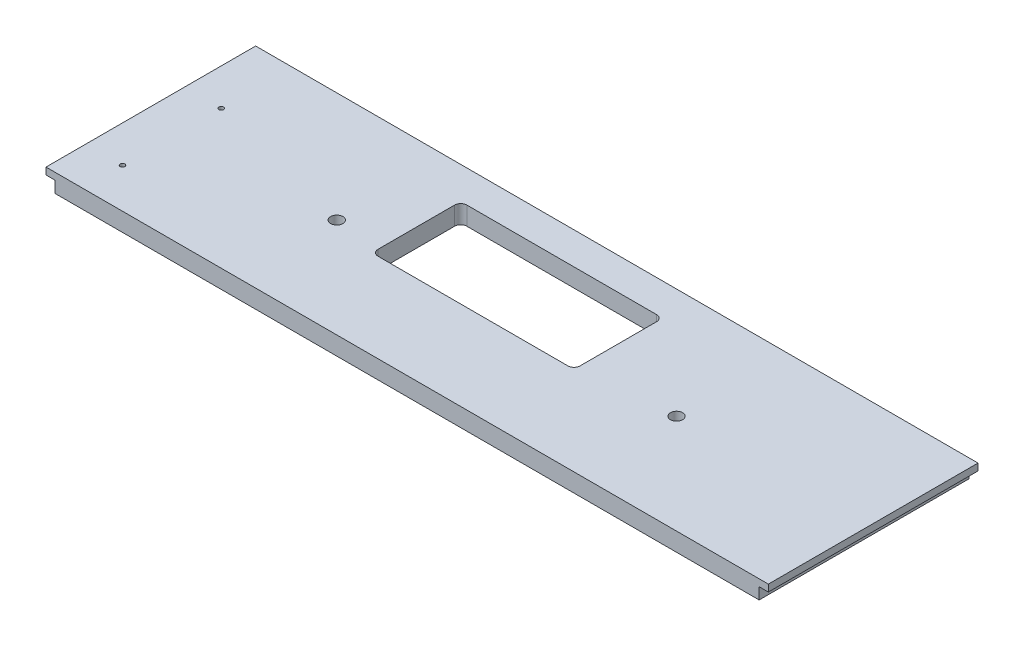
ISO-10303-21;
HEADER;
FILE_DESCRIPTION(('STEP AP214'),'2;1');
FILE_NAME('part.step','',(''),(''),'','','');
FILE_SCHEMA(('AUTOMOTIVE_DESIGN { 1 0 10303 214 1 1 1 1 }'));
ENDSEC;
DATA;
#1=APPLICATION_CONTEXT('core data for automotive mechanical design processes');
#2=APPLICATION_PROTOCOL_DEFINITION('international standard','automotive_design',2000,#1);
#3=PRODUCT_CONTEXT('',#1,'mechanical');
#4=PRODUCT('Part','Part','',(#3));
#5=PRODUCT_RELATED_PRODUCT_CATEGORY('part','',(#4));
#6=PRODUCT_DEFINITION_FORMATION('','',#4);
#7=PRODUCT_DEFINITION_CONTEXT('part definition',#1,'design');
#8=PRODUCT_DEFINITION('design','',#6,#7);
#9=PRODUCT_DEFINITION_SHAPE('','',#8);
#10=(LENGTH_UNIT() NAMED_UNIT(*) SI_UNIT(.MILLI.,.METRE.));
#11=(NAMED_UNIT(*) PLANE_ANGLE_UNIT() SI_UNIT($,.RADIAN.));
#12=(NAMED_UNIT(*) SI_UNIT($,.STERADIAN.) SOLID_ANGLE_UNIT());
#13=UNCERTAINTY_MEASURE_WITH_UNIT(LENGTH_MEASURE(1.E-05),#10,'distance_accuracy_value','');
#14=(GEOMETRIC_REPRESENTATION_CONTEXT(3) GLOBAL_UNCERTAINTY_ASSIGNED_CONTEXT((#13)) GLOBAL_UNIT_ASSIGNED_CONTEXT((#10,
#11,#12)) REPRESENTATION_CONTEXT('',''));
#15=CARTESIAN_POINT('',(0.,0.,0.));
#16=DIRECTION('',(0.,0.,1.));
#17=DIRECTION('',(1.,0.,0.));
#18=AXIS2_PLACEMENT_3D('',#15,#16,#17);
#19=CARTESIAN_POINT('',(374.65,19.05,-108.74375));
#20=DIRECTION('',(-1.,0.,0.));
#21=DIRECTION('',(0.,0.,1.));
#22=AXIS2_PLACEMENT_3D('',#19,#20,#21);
#23=PLANE('',#22);
#24=DIRECTION('',(0.,-1.,0.));
#25=VECTOR('',#24,1.);
#26=CARTESIAN_POINT('',(374.65,19.05,108.74375));
#27=LINE('',#26,#25);
#28=CARTESIAN_POINT('',(374.65,19.05,108.74375));
#29=VERTEX_POINT('',#28);
#30=CARTESIAN_POINT('',(374.65,11.90625,108.74375));
#31=VERTEX_POINT('',#30);
#32=EDGE_CURVE('E268',#29,#31,#27,.T.);
#33=ORIENTED_EDGE('',*,*,#32,.T.);
#34=DIRECTION('',(0.,0.,1.));
#35=VECTOR('',#34,1.);
#36=CARTESIAN_POINT('',(374.65,11.90625,-108.74375));
#37=LINE('',#36,#35);
#38=CARTESIAN_POINT('',(374.65,11.90625,-108.74375));
#39=VERTEX_POINT('',#38);
#40=EDGE_CURVE('E185',#39,#31,#37,.T.);
#41=ORIENTED_EDGE('',*,*,#40,.F.);
#42=DIRECTION('',(0.,-1.,0.));
#43=VECTOR('',#42,1.);
#44=CARTESIAN_POINT('',(374.65,19.05,-108.74375));
#45=LINE('',#44,#43);
#46=CARTESIAN_POINT('',(374.65,19.05,-108.74375));
#47=VERTEX_POINT('',#46);
#48=EDGE_CURVE('E11',#47,#39,#45,.T.);
#49=ORIENTED_EDGE('',*,*,#48,.F.);
#50=DIRECTION('',(0.,0.,-1.));
#51=VECTOR('',#50,1.);
#52=CARTESIAN_POINT('',(374.65,19.05,-108.74375));
#53=LINE('',#52,#51);
#54=EDGE_CURVE('E259',#29,#47,#53,.T.);
#55=ORIENTED_EDGE('',*,*,#54,.F.);
#56=EDGE_LOOP('',(#33,#41,#49,#55));
#57=FACE_BOUND('',#56,.T.);
#58=ADVANCED_FACE('F33',(#57),#23,.F.);
#59=CARTESIAN_POINT('',(-374.65,19.05,-108.74375));
#60=DIRECTION('',(0.,0.,1.));
#61=DIRECTION('',(1.,0.,0.));
#62=AXIS2_PLACEMENT_3D('',#59,#60,#61);
#63=PLANE('',#62);
#64=DIRECTION('',(0.,1.,0.));
#65=VECTOR('',#64,1.);
#66=CARTESIAN_POINT('',(-365.125,0.,-108.74375));
#67=LINE('',#66,#65);
#68=CARTESIAN_POINT('',(-365.125,0.,-108.74375));
#69=VERTEX_POINT('',#68);
#70=CARTESIAN_POINT('',(-365.125,11.9062499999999,-108.74375));
#71=VERTEX_POINT('',#70);
#72=EDGE_CURVE('E47',#69,#71,#67,.T.);
#73=ORIENTED_EDGE('',*,*,#72,.T.);
#74=DIRECTION('',(-1.,0.,0.));
#75=VECTOR('',#74,1.);
#76=CARTESIAN_POINT('',(-374.65,11.9062499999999,-108.74375));
#77=LINE('',#76,#75);
#78=CARTESIAN_POINT('',(-374.65,11.9062499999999,-108.74375));
#79=VERTEX_POINT('',#78);
#80=EDGE_CURVE('E155',#71,#79,#77,.T.);
#81=ORIENTED_EDGE('',*,*,#80,.T.);
#82=DIRECTION('',(0.,-1.,0.));
#83=VECTOR('',#82,1.);
#84=CARTESIAN_POINT('',(-374.65,19.05,-108.74375));
#85=LINE('',#84,#83);
#86=CARTESIAN_POINT('',(-374.65,19.05,-108.74375));
#87=VERTEX_POINT('',#86);
#88=EDGE_CURVE('E40',#87,#79,#85,.T.);
#89=ORIENTED_EDGE('',*,*,#88,.F.);
#90=DIRECTION('',(-1.,0.,0.));
#91=VECTOR('',#90,1.);
#92=CARTESIAN_POINT('',(-374.65,19.05,-108.74375));
#93=LINE('',#92,#91);
#94=EDGE_CURVE('E262',#47,#87,#93,.T.);
#95=ORIENTED_EDGE('',*,*,#94,.F.);
#96=ORIENTED_EDGE('',*,*,#48,.T.);
#97=DIRECTION('',(-1.,0.,0.));
#98=VECTOR('',#97,1.);
#99=CARTESIAN_POINT('',(374.65,11.90625,-108.74375));
#100=LINE('',#99,#98);
#101=CARTESIAN_POINT('',(365.125,11.90625,-108.74375));
#102=VERTEX_POINT('',#101);
#103=EDGE_CURVE('E179',#39,#102,#100,.T.);
#104=ORIENTED_EDGE('',*,*,#103,.T.);
#105=DIRECTION('',(0.,-1.,0.));
#106=VECTOR('',#105,1.);
#107=CARTESIAN_POINT('',(365.125,0.,-108.74375));
#108=LINE('',#107,#106);
#109=CARTESIAN_POINT('',(365.125,0.,-108.74375));
#110=VERTEX_POINT('',#109);
#111=EDGE_CURVE('E182',#102,#110,#108,.T.);
#112=ORIENTED_EDGE('',*,*,#111,.T.);
#113=DIRECTION('',(-1.,0.,0.));
#114=VECTOR('',#113,1.);
#115=CARTESIAN_POINT('',(-374.65,0.,-108.74375));
#116=LINE('',#115,#114);
#117=EDGE_CURVE('E166',#110,#69,#116,.T.);
#118=ORIENTED_EDGE('',*,*,#117,.T.);
#119=EDGE_LOOP('',(#73,#81,#89,#95,#96,#104,#112,#118));
#120=FACE_BOUND('',#119,.T.);
#121=ADVANCED_FACE('F163',(#120),#63,.F.);
#122=CARTESIAN_POINT('',(-374.65,19.05,-108.74375));
#123=DIRECTION('',(1.,0.,0.));
#124=DIRECTION('',(0.,0.,-1.));
#125=AXIS2_PLACEMENT_3D('',#122,#123,#124);
#126=PLANE('',#125);
#127=ORIENTED_EDGE('',*,*,#88,.T.);
#128=DIRECTION('',(0.,0.,1.));
#129=VECTOR('',#128,1.);
#130=CARTESIAN_POINT('',(-374.65,11.9062499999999,-108.74375));
#131=LINE('',#130,#129);
#132=CARTESIAN_POINT('',(-374.65,11.9062499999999,108.74375));
#133=VERTEX_POINT('',#132);
#134=EDGE_CURVE('E151',#79,#133,#131,.T.);
#135=ORIENTED_EDGE('',*,*,#134,.T.);
#136=DIRECTION('',(0.,-1.,0.));
#137=VECTOR('',#136,1.);
#138=CARTESIAN_POINT('',(-374.65,19.05,108.74375));
#139=LINE('',#138,#137);
#140=CARTESIAN_POINT('',(-374.65,19.05,108.74375));
#141=VERTEX_POINT('',#140);
#142=EDGE_CURVE('E273',#141,#133,#139,.T.);
#143=ORIENTED_EDGE('',*,*,#142,.F.);
#144=DIRECTION('',(0.,0.,1.));
#145=VECTOR('',#144,1.);
#146=CARTESIAN_POINT('',(-374.65,19.05,-108.74375));
#147=LINE('',#146,#145);
#148=EDGE_CURVE('E264',#87,#141,#147,.T.);
#149=ORIENTED_EDGE('',*,*,#148,.F.);
#150=EDGE_LOOP('',(#127,#135,#143,#149));
#151=FACE_BOUND('',#150,.T.);
#152=ADVANCED_FACE('F277',(#151),#126,.F.);
#153=CARTESIAN_POINT('',(-374.65,19.05,108.74375));
#154=DIRECTION('',(0.,0.,-1.));
#155=DIRECTION('',(-1.,0.,0.));
#156=AXIS2_PLACEMENT_3D('',#153,#154,#155);
#157=PLANE('',#156);
#158=ORIENTED_EDGE('',*,*,#142,.T.);
#159=DIRECTION('',(-1.,0.,0.));
#160=VECTOR('',#159,1.);
#161=CARTESIAN_POINT('',(-374.65,11.9062499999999,108.74375));
#162=LINE('',#161,#160);
#163=CARTESIAN_POINT('',(-365.125,11.9062499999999,108.74375));
#164=VERTEX_POINT('',#163);
#165=EDGE_CURVE('E167',#164,#133,#162,.T.);
#166=ORIENTED_EDGE('',*,*,#165,.F.);
#167=DIRECTION('',(0.,1.,0.));
#168=VECTOR('',#167,1.);
#169=CARTESIAN_POINT('',(-365.125,0.,108.74375));
#170=LINE('',#169,#168);
#171=CARTESIAN_POINT('',(-365.125,0.,108.74375));
#172=VERTEX_POINT('',#171);
#173=EDGE_CURVE('E148',#172,#164,#170,.T.);
#174=ORIENTED_EDGE('',*,*,#173,.F.);
#175=DIRECTION('',(1.,0.,0.));
#176=VECTOR('',#175,1.);
#177=CARTESIAN_POINT('',(-374.65,0.,108.74375));
#178=LINE('',#177,#176);
#179=CARTESIAN_POINT('',(365.125,0.,108.74375));
#180=VERTEX_POINT('',#179);
#181=EDGE_CURVE('E55',#172,#180,#178,.T.);
#182=ORIENTED_EDGE('',*,*,#181,.T.);
#183=DIRECTION('',(0.,-1.,0.));
#184=VECTOR('',#183,1.);
#185=CARTESIAN_POINT('',(365.125,0.,108.74375));
#186=LINE('',#185,#184);
#187=CARTESIAN_POINT('',(365.125,11.90625,108.74375));
#188=VERTEX_POINT('',#187);
#189=EDGE_CURVE('E183',#188,#180,#186,.T.);
#190=ORIENTED_EDGE('',*,*,#189,.F.);
#191=DIRECTION('',(-1.,0.,0.));
#192=VECTOR('',#191,1.);
#193=CARTESIAN_POINT('',(374.65,11.90625,108.74375));
#194=LINE('',#193,#192);
#195=EDGE_CURVE('E176',#31,#188,#194,.T.);
#196=ORIENTED_EDGE('',*,*,#195,.F.);
#197=ORIENTED_EDGE('',*,*,#32,.F.);
#198=DIRECTION('',(1.,0.,0.));
#199=VECTOR('',#198,1.);
#200=CARTESIAN_POINT('',(-374.65,19.05,108.74375));
#201=LINE('',#200,#199);
#202=EDGE_CURVE('E266',#141,#29,#201,.T.);
#203=ORIENTED_EDGE('',*,*,#202,.F.);
#204=EDGE_LOOP('',(#158,#166,#174,#182,#190,#196,#197,#203));
#205=FACE_BOUND('',#204,.T.);
#206=ADVANCED_FACE('F290',(#205),#157,.F.);
#207=CARTESIAN_POINT('',(0.,19.05,0.));
#208=DIRECTION('',(0.,1.,0.));
#209=DIRECTION('',(0.,0.,1.));
#210=AXIS2_PLACEMENT_3D('',#207,#208,#209);
#211=PLANE('',#210);
#212=CARTESIAN_POINT('',(-336.55,19.05,67.46875));
#213=DIRECTION('',(0.,-1.,0.));
#214=DIRECTION('',(0.,0.,-1.));
#215=AXIS2_PLACEMENT_3D('',#212,#213,#214);
#216=CIRCLE('',#215,2.41299999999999);
#217=CARTESIAN_POINT('',(-336.55,19.05,65.05575));
#218=VERTEX_POINT('',#217);
#219=EDGE_CURVE('E616',#218,#218,#216,.T.);
#220=ORIENTED_EDGE('',*,*,#219,.T.);
#221=EDGE_LOOP('',(#220));
#222=FACE_BOUND('',#221,.T.);
#223=CARTESIAN_POINT('',(-336.55,19.05,-34.925));
#224=DIRECTION('',(0.,-1.,0.));
#225=DIRECTION('',(0.,0.,-1.));
#226=AXIS2_PLACEMENT_3D('',#223,#224,#225);
#227=CIRCLE('',#226,2.41299999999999);
#228=CARTESIAN_POINT('',(-336.55,19.05,-37.338));
#229=VERTEX_POINT('',#228);
#230=EDGE_CURVE('E610',#229,#229,#227,.T.);
#231=ORIENTED_EDGE('',*,*,#230,.T.);
#232=EDGE_LOOP('',(#231));
#233=FACE_BOUND('',#232,.T.);
#234=CARTESIAN_POINT('',(176.2125,19.05,5.55625000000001));
#235=DIRECTION('',(0.,1.,0.));
#236=DIRECTION('',(0.,0.,1.));
#237=AXIS2_PLACEMENT_3D('',#234,#235,#236);
#238=CIRCLE('',#237,6.35);
#239=CARTESIAN_POINT('',(176.2125,19.05,11.90625));
#240=VERTEX_POINT('',#239);
#241=EDGE_CURVE('E605',#240,#240,#238,.T.);
#242=ORIENTED_EDGE('',*,*,#241,.F.);
#243=EDGE_LOOP('',(#242));
#244=FACE_BOUND('',#243,.T.);
#245=CARTESIAN_POINT('',(-176.2125,19.05,5.55625000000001));
#246=DIRECTION('',(0.,1.,0.));
#247=DIRECTION('',(0.,0.,1.));
#248=AXIS2_PLACEMENT_3D('',#245,#246,#247);
#249=CIRCLE('',#248,6.35);
#250=CARTESIAN_POINT('',(-176.2125,19.05,11.90625));
#251=VERTEX_POINT('',#250);
#252=EDGE_CURVE('E171',#251,#251,#249,.T.);
#253=ORIENTED_EDGE('',*,*,#252,.F.);
#254=EDGE_LOOP('',(#253));
#255=FACE_BOUND('',#254,.T.);
#256=CARTESIAN_POINT('',(74.6125,19.05,10.31875));
#257=DIRECTION('',(0.,1.,0.));
#258=DIRECTION('',(0.,0.,1.));
#259=AXIS2_PLACEMENT_3D('',#256,#257,#258);
#260=CIRCLE('',#259,6.35);
#261=CARTESIAN_POINT('',(74.6124999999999,19.05,16.66875));
#262=VERTEX_POINT('',#261);
#263=CARTESIAN_POINT('',(80.9625,19.05,10.31875));
#264=VERTEX_POINT('',#263);
#265=EDGE_CURVE('E192',#262,#264,#260,.T.);
#266=ORIENTED_EDGE('',*,*,#265,.F.);
#267=DIRECTION('',(1.,0.,0.));
#268=VECTOR('',#267,1.);
#269=CARTESIAN_POINT('',(-122.2375,19.05,16.66875));
#270=LINE('',#269,#268);
#271=CARTESIAN_POINT('',(-122.2375,19.05,16.66875));
#272=VERTEX_POINT('',#271);
#273=EDGE_CURVE('E200',#272,#262,#270,.T.);
#274=ORIENTED_EDGE('',*,*,#273,.F.);
#275=CARTESIAN_POINT('',(-122.2375,19.05,10.31875));
#276=DIRECTION('',(0.,1.,0.));
#277=DIRECTION('',(0.,0.,1.));
#278=AXIS2_PLACEMENT_3D('',#275,#276,#277);
#279=CIRCLE('',#278,6.35);
#280=CARTESIAN_POINT('',(-128.5875,19.05,10.31875));
#281=VERTEX_POINT('',#280);
#282=EDGE_CURVE('E238',#281,#272,#279,.T.);
#283=ORIENTED_EDGE('',*,*,#282,.F.);
#284=DIRECTION('',(0.,0.,1.));
#285=VECTOR('',#284,1.);
#286=CARTESIAN_POINT('',(-128.5875,19.05,-69.0562499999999));
#287=LINE('',#286,#285);
#288=CARTESIAN_POINT('',(-128.5875,19.05,-69.0562499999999));
#289=VERTEX_POINT('',#288);
#290=EDGE_CURVE('E235',#289,#281,#287,.T.);
#291=ORIENTED_EDGE('',*,*,#290,.F.);
#292=CARTESIAN_POINT('',(-122.2375,19.05,-69.05625));
#293=DIRECTION('',(0.,1.,0.));
#294=DIRECTION('',(0.,0.,1.));
#295=AXIS2_PLACEMENT_3D('',#292,#293,#294);
#296=CIRCLE('',#295,6.34999999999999);
#297=CARTESIAN_POINT('',(-122.2375,19.05,-75.40625));
#298=VERTEX_POINT('',#297);
#299=EDGE_CURVE('E232',#298,#289,#296,.T.);
#300=ORIENTED_EDGE('',*,*,#299,.F.);
#301=DIRECTION('',(-1.,0.,0.));
#302=VECTOR('',#301,1.);
#303=CARTESIAN_POINT('',(-122.2375,19.05,-75.40625));
#304=LINE('',#303,#302);
#305=CARTESIAN_POINT('',(74.6124999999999,19.05,-75.40625));
#306=VERTEX_POINT('',#305);
#307=EDGE_CURVE('E229',#306,#298,#304,.T.);
#308=ORIENTED_EDGE('',*,*,#307,.F.);
#309=CARTESIAN_POINT('',(74.6125,19.05,-69.05625));
#310=DIRECTION('',(0.,1.,0.));
#311=DIRECTION('',(0.,0.,-1.));
#312=AXIS2_PLACEMENT_3D('',#309,#310,#311);
#313=CIRCLE('',#312,6.34999999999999);
#314=CARTESIAN_POINT('',(80.9625,19.05,-69.0562499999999));
#315=VERTEX_POINT('',#314);
#316=EDGE_CURVE('E226',#315,#306,#313,.T.);
#317=ORIENTED_EDGE('',*,*,#316,.F.);
#318=DIRECTION('',(0.,0.,-1.));
#319=VECTOR('',#318,1.);
#320=CARTESIAN_POINT('',(80.9625,19.05,-69.0562499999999));
#321=LINE('',#320,#319);
#322=EDGE_CURVE('E223',#264,#315,#321,.T.);
#323=ORIENTED_EDGE('',*,*,#322,.F.);
#324=EDGE_LOOP('',(#266,#274,#283,#291,#300,#308,#317,#323));
#325=FACE_BOUND('',#324,.T.);
#326=ORIENTED_EDGE('',*,*,#54,.T.);
#327=ORIENTED_EDGE('',*,*,#94,.T.);
#328=ORIENTED_EDGE('',*,*,#148,.T.);
#329=ORIENTED_EDGE('',*,*,#202,.T.);
#330=EDGE_LOOP('',(#326,#327,#328,#329));
#331=FACE_BOUND('',#330,.T.);
#332=ADVANCED_FACE('F282',(#222,#233,#244,#255,#325,#331),#211,.T.);
#333=CARTESIAN_POINT('',(0.,0.,0.));
#334=DIRECTION('',(0.,1.,0.));
#335=DIRECTION('',(0.,0.,1.));
#336=AXIS2_PLACEMENT_3D('',#333,#334,#335);
#337=PLANE('',#336);
#338=CARTESIAN_POINT('',(352.425,0.,-96.04375));
#339=DIRECTION('',(0.,-1.,0.));
#340=DIRECTION('',(0.,0.,-1.));
#341=AXIS2_PLACEMENT_3D('',#338,#339,#340);
#342=CIRCLE('',#341,0.39687500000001);
#343=CARTESIAN_POINT('',(352.425,0.,-96.440625));
#344=VERTEX_POINT('',#343);
#345=EDGE_CURVE('E643',#344,#344,#342,.T.);
#346=ORIENTED_EDGE('',*,*,#345,.F.);
#347=EDGE_LOOP('',(#346));
#348=FACE_BOUND('',#347,.T.);
#349=CARTESIAN_POINT('',(352.425,0.,92.86875));
#350=DIRECTION('',(0.,-1.,0.));
#351=DIRECTION('',(0.,0.,-1.));
#352=AXIS2_PLACEMENT_3D('',#349,#350,#351);
#353=CIRCLE('',#352,0.39687500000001);
#354=CARTESIAN_POINT('',(352.425,0.,92.471875));
#355=VERTEX_POINT('',#354);
#356=EDGE_CURVE('E637',#355,#355,#353,.T.);
#357=ORIENTED_EDGE('',*,*,#356,.F.);
#358=EDGE_LOOP('',(#357));
#359=FACE_BOUND('',#358,.T.);
#360=CARTESIAN_POINT('',(-352.425,0.,92.86875));
#361=DIRECTION('',(0.,-1.,0.));
#362=DIRECTION('',(0.,0.,-1.));
#363=AXIS2_PLACEMENT_3D('',#360,#361,#362);
#364=CIRCLE('',#363,0.39687500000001);
#365=CARTESIAN_POINT('',(-352.425,0.,92.471875));
#366=VERTEX_POINT('',#365);
#367=EDGE_CURVE('E631',#366,#366,#364,.T.);
#368=ORIENTED_EDGE('',*,*,#367,.F.);
#369=EDGE_LOOP('',(#368));
#370=FACE_BOUND('',#369,.T.);
#371=CARTESIAN_POINT('',(-352.425,0.,-96.04375));
#372=DIRECTION('',(0.,-1.,0.));
#373=DIRECTION('',(0.,0.,-1.));
#374=AXIS2_PLACEMENT_3D('',#371,#372,#373);
#375=CIRCLE('',#374,0.39687500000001);
#376=CARTESIAN_POINT('',(-352.425,0.,-96.440625));
#377=VERTEX_POINT('',#376);
#378=EDGE_CURVE('E625',#377,#377,#375,.T.);
#379=ORIENTED_EDGE('',*,*,#378,.F.);
#380=EDGE_LOOP('',(#379));
#381=FACE_BOUND('',#380,.T.);
#382=CARTESIAN_POINT('',(-336.55,0.,67.46875));
#383=DIRECTION('',(0.,-1.,0.));
#384=DIRECTION('',(0.,0.,-1.));
#385=AXIS2_PLACEMENT_3D('',#382,#383,#384);
#386=CIRCLE('',#385,2.41299999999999);
#387=CARTESIAN_POINT('',(-336.55,0.,65.05575));
#388=VERTEX_POINT('',#387);
#389=EDGE_CURVE('E619',#388,#388,#386,.T.);
#390=ORIENTED_EDGE('',*,*,#389,.F.);
#391=EDGE_LOOP('',(#390));
#392=FACE_BOUND('',#391,.T.);
#393=CARTESIAN_POINT('',(-336.55,0.,-34.925));
#394=DIRECTION('',(0.,-1.,0.));
#395=DIRECTION('',(0.,0.,-1.));
#396=AXIS2_PLACEMENT_3D('',#393,#394,#395);
#397=CIRCLE('',#396,2.41299999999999);
#398=CARTESIAN_POINT('',(-336.55,0.,-37.338));
#399=VERTEX_POINT('',#398);
#400=EDGE_CURVE('E613',#399,#399,#397,.T.);
#401=ORIENTED_EDGE('',*,*,#400,.F.);
#402=EDGE_LOOP('',(#401));
#403=FACE_BOUND('',#402,.T.);
#404=CARTESIAN_POINT('',(176.2125,0.,5.55625000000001));
#405=DIRECTION('',(0.,1.,0.));
#406=DIRECTION('',(0.,0.,1.));
#407=AXIS2_PLACEMENT_3D('',#404,#405,#406);
#408=CIRCLE('',#407,6.35);
#409=CARTESIAN_POINT('',(176.2125,0.,11.90625));
#410=VERTEX_POINT('',#409);
#411=EDGE_CURVE('E603',#410,#410,#408,.T.);
#412=ORIENTED_EDGE('',*,*,#411,.T.);
#413=EDGE_LOOP('',(#412));
#414=FACE_BOUND('',#413,.T.);
#415=CARTESIAN_POINT('',(-176.2125,0.,5.55625000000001));
#416=DIRECTION('',(0.,1.,0.));
#417=DIRECTION('',(0.,0.,1.));
#418=AXIS2_PLACEMENT_3D('',#415,#416,#417);
#419=CIRCLE('',#418,6.35);
#420=CARTESIAN_POINT('',(-176.2125,0.,11.90625));
#421=VERTEX_POINT('',#420);
#422=EDGE_CURVE('E174',#421,#421,#419,.T.);
#423=ORIENTED_EDGE('',*,*,#422,.T.);
#424=EDGE_LOOP('',(#423));
#425=FACE_BOUND('',#424,.T.);
#426=DIRECTION('',(1.,0.,0.));
#427=VECTOR('',#426,1.);
#428=CARTESIAN_POINT('',(-122.2375,0.,16.66875));
#429=LINE('',#428,#427);
#430=CARTESIAN_POINT('',(-122.2375,0.,16.66875));
#431=VERTEX_POINT('',#430);
#432=CARTESIAN_POINT('',(74.6124999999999,0.,16.66875));
#433=VERTEX_POINT('',#432);
#434=EDGE_CURVE('E218',#431,#433,#429,.T.);
#435=ORIENTED_EDGE('',*,*,#434,.T.);
#436=CARTESIAN_POINT('',(74.6125,0.,10.31875));
#437=DIRECTION('',(0.,1.,0.));
#438=DIRECTION('',(0.,0.,1.));
#439=AXIS2_PLACEMENT_3D('',#436,#437,#438);
#440=CIRCLE('',#439,6.35);
#441=CARTESIAN_POINT('',(80.9625,0.,10.31875));
#442=VERTEX_POINT('',#441);
#443=EDGE_CURVE('E196',#433,#442,#440,.T.);
#444=ORIENTED_EDGE('',*,*,#443,.T.);
#445=DIRECTION('',(0.,0.,-1.));
#446=VECTOR('',#445,1.);
#447=CARTESIAN_POINT('',(80.9625,0.,-69.0562499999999));
#448=LINE('',#447,#446);
#449=CARTESIAN_POINT('',(80.9625,0.,-69.0562499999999));
#450=VERTEX_POINT('',#449);
#451=EDGE_CURVE('E199',#442,#450,#448,.T.);
#452=ORIENTED_EDGE('',*,*,#451,.T.);
#453=CARTESIAN_POINT('',(74.6125,0.,-69.05625));
#454=DIRECTION('',(0.,1.,0.));
#455=DIRECTION('',(0.,0.,-1.));
#456=AXIS2_PLACEMENT_3D('',#453,#454,#455);
#457=CIRCLE('',#456,6.34999999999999);
#458=CARTESIAN_POINT('',(74.6124999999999,0.,-75.40625));
#459=VERTEX_POINT('',#458);
#460=EDGE_CURVE('E203',#450,#459,#457,.T.);
#461=ORIENTED_EDGE('',*,*,#460,.T.);
#462=DIRECTION('',(-1.,0.,0.));
#463=VECTOR('',#462,1.);
#464=CARTESIAN_POINT('',(-122.2375,0.,-75.40625));
#465=LINE('',#464,#463);
#466=CARTESIAN_POINT('',(-122.2375,0.,-75.40625));
#467=VERTEX_POINT('',#466);
#468=EDGE_CURVE('E206',#459,#467,#465,.T.);
#469=ORIENTED_EDGE('',*,*,#468,.T.);
#470=CARTESIAN_POINT('',(-122.2375,0.,-69.05625));
#471=DIRECTION('',(0.,1.,0.));
#472=DIRECTION('',(0.,0.,1.));
#473=AXIS2_PLACEMENT_3D('',#470,#471,#472);
#474=CIRCLE('',#473,6.34999999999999);
#475=CARTESIAN_POINT('',(-128.5875,0.,-69.0562499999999));
#476=VERTEX_POINT('',#475);
#477=EDGE_CURVE('E209',#467,#476,#474,.T.);
#478=ORIENTED_EDGE('',*,*,#477,.T.);
#479=DIRECTION('',(0.,0.,1.));
#480=VECTOR('',#479,1.);
#481=CARTESIAN_POINT('',(-128.5875,0.,-69.0562499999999));
#482=LINE('',#481,#480);
#483=CARTESIAN_POINT('',(-128.5875,0.,10.31875));
#484=VERTEX_POINT('',#483);
#485=EDGE_CURVE('E212',#476,#484,#482,.T.);
#486=ORIENTED_EDGE('',*,*,#485,.T.);
#487=CARTESIAN_POINT('',(-122.2375,0.,10.31875));
#488=DIRECTION('',(0.,1.,0.));
#489=DIRECTION('',(0.,0.,1.));
#490=AXIS2_PLACEMENT_3D('',#487,#488,#489);
#491=CIRCLE('',#490,6.35);
#492=EDGE_CURVE('E215',#484,#431,#491,.T.);
#493=ORIENTED_EDGE('',*,*,#492,.T.);
#494=EDGE_LOOP('',(#435,#444,#452,#461,#469,#478,#486,#493));
#495=FACE_BOUND('',#494,.T.);
#496=ORIENTED_EDGE('',*,*,#181,.F.);
#497=DIRECTION('',(0.,0.,1.));
#498=VECTOR('',#497,1.);
#499=CARTESIAN_POINT('',(-365.125,0.,-108.74375));
#500=LINE('',#499,#498);
#501=EDGE_CURVE('E152',#69,#172,#500,.T.);
#502=ORIENTED_EDGE('',*,*,#501,.F.);
#503=ORIENTED_EDGE('',*,*,#117,.F.);
#504=DIRECTION('',(0.,0.,1.));
#505=VECTOR('',#504,1.);
#506=CARTESIAN_POINT('',(365.125,0.,-108.74375));
#507=LINE('',#506,#505);
#508=EDGE_CURVE('E189',#110,#180,#507,.T.);
#509=ORIENTED_EDGE('',*,*,#508,.T.);
#510=EDGE_LOOP('',(#496,#502,#503,#509));
#511=FACE_BOUND('',#510,.T.);
#512=ADVANCED_FACE('F295',(#348,#359,#370,#381,#392,#403,#414,#425,#495,#511),#337,.F.);
#513=CARTESIAN_POINT('',(74.6125,0.,10.31875));
#514=DIRECTION('',(0.,1.,0.));
#515=DIRECTION('',(0.,0.,1.));
#516=AXIS2_PLACEMENT_3D('',#513,#514,#515);
#517=CYLINDRICAL_SURFACE('',#516,6.35);
#518=ORIENTED_EDGE('',*,*,#265,.T.);
#519=DIRECTION('',(0.,1.,0.));
#520=VECTOR('',#519,1.);
#521=CARTESIAN_POINT('',(80.9625,0.,10.31875));
#522=LINE('',#521,#520);
#523=EDGE_CURVE('E221',#442,#264,#522,.T.);
#524=ORIENTED_EDGE('',*,*,#523,.F.);
#525=ORIENTED_EDGE('',*,*,#443,.F.);
#526=DIRECTION('',(0.,1.,0.));
#527=VECTOR('',#526,1.);
#528=CARTESIAN_POINT('',(74.6124999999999,0.,16.66875));
#529=LINE('',#528,#527);
#530=EDGE_CURVE('E243',#433,#262,#529,.T.);
#531=ORIENTED_EDGE('',*,*,#530,.T.);
#532=EDGE_LOOP('',(#518,#524,#525,#531));
#533=FACE_BOUND('',#532,.T.);
#534=ADVANCED_FACE('F297',(#533),#517,.F.);
#535=CARTESIAN_POINT('',(-122.2375,0.,16.66875));
#536=DIRECTION('',(0.,0.,1.));
#537=DIRECTION('',(1.,0.,0.));
#538=AXIS2_PLACEMENT_3D('',#535,#536,#537);
#539=PLANE('',#538);
#540=ORIENTED_EDGE('',*,*,#273,.T.);
#541=ORIENTED_EDGE('',*,*,#530,.F.);
#542=ORIENTED_EDGE('',*,*,#434,.F.);
#543=DIRECTION('',(0.,1.,0.));
#544=VECTOR('',#543,1.);
#545=CARTESIAN_POINT('',(-122.2375,0.,16.66875));
#546=LINE('',#545,#544);
#547=EDGE_CURVE('E245',#431,#272,#546,.T.);
#548=ORIENTED_EDGE('',*,*,#547,.T.);
#549=EDGE_LOOP('',(#540,#541,#542,#548));
#550=FACE_BOUND('',#549,.T.);
#551=ADVANCED_FACE('F304',(#550),#539,.F.);
#552=CARTESIAN_POINT('',(-122.2375,0.,10.31875));
#553=DIRECTION('',(0.,1.,0.));
#554=DIRECTION('',(0.,0.,1.));
#555=AXIS2_PLACEMENT_3D('',#552,#553,#554);
#556=CYLINDRICAL_SURFACE('',#555,6.35);
#557=ORIENTED_EDGE('',*,*,#282,.T.);
#558=ORIENTED_EDGE('',*,*,#547,.F.);
#559=ORIENTED_EDGE('',*,*,#492,.F.);
#560=DIRECTION('',(0.,1.,0.));
#561=VECTOR('',#560,1.);
#562=CARTESIAN_POINT('',(-128.5875,0.,10.31875));
#563=LINE('',#562,#561);
#564=EDGE_CURVE('E247',#484,#281,#563,.T.);
#565=ORIENTED_EDGE('',*,*,#564,.T.);
#566=EDGE_LOOP('',(#557,#558,#559,#565));
#567=FACE_BOUND('',#566,.T.);
#568=ADVANCED_FACE('F464',(#567),#556,.F.);
#569=CARTESIAN_POINT('',(-128.5875,0.,-69.0562499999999));
#570=DIRECTION('',(-1.,0.,0.));
#571=DIRECTION('',(0.,0.,1.));
#572=AXIS2_PLACEMENT_3D('',#569,#570,#571);
#573=PLANE('',#572);
#574=ORIENTED_EDGE('',*,*,#290,.T.);
#575=ORIENTED_EDGE('',*,*,#564,.F.);
#576=ORIENTED_EDGE('',*,*,#485,.F.);
#577=DIRECTION('',(0.,1.,0.));
#578=VECTOR('',#577,1.);
#579=CARTESIAN_POINT('',(-128.5875,0.,-69.0562499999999));
#580=LINE('',#579,#578);
#581=EDGE_CURVE('E249',#476,#289,#580,.T.);
#582=ORIENTED_EDGE('',*,*,#581,.T.);
#583=EDGE_LOOP('',(#574,#575,#576,#582));
#584=FACE_BOUND('',#583,.T.);
#585=ADVANCED_FACE('F468',(#584),#573,.F.);
#586=CARTESIAN_POINT('',(-122.2375,0.,-69.05625));
#587=DIRECTION('',(0.,1.,0.));
#588=DIRECTION('',(0.,0.,1.));
#589=AXIS2_PLACEMENT_3D('',#586,#587,#588);
#590=CYLINDRICAL_SURFACE('',#589,6.34999999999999);
#591=ORIENTED_EDGE('',*,*,#299,.T.);
#592=ORIENTED_EDGE('',*,*,#581,.F.);
#593=ORIENTED_EDGE('',*,*,#477,.F.);
#594=DIRECTION('',(0.,1.,0.));
#595=VECTOR('',#594,1.);
#596=CARTESIAN_POINT('',(-122.2375,0.,-75.40625));
#597=LINE('',#596,#595);
#598=EDGE_CURVE('E251',#467,#298,#597,.T.);
#599=ORIENTED_EDGE('',*,*,#598,.T.);
#600=EDGE_LOOP('',(#591,#592,#593,#599));
#601=FACE_BOUND('',#600,.T.);
#602=ADVANCED_FACE('F472',(#601),#590,.F.);
#603=CARTESIAN_POINT('',(-122.2375,0.,-75.40625));
#604=DIRECTION('',(0.,0.,-1.));
#605=DIRECTION('',(-1.,0.,0.));
#606=AXIS2_PLACEMENT_3D('',#603,#604,#605);
#607=PLANE('',#606);
#608=ORIENTED_EDGE('',*,*,#307,.T.);
#609=ORIENTED_EDGE('',*,*,#598,.F.);
#610=ORIENTED_EDGE('',*,*,#468,.F.);
#611=DIRECTION('',(0.,1.,0.));
#612=VECTOR('',#611,1.);
#613=CARTESIAN_POINT('',(74.6124999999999,0.,-75.40625));
#614=LINE('',#613,#612);
#615=EDGE_CURVE('E253',#459,#306,#614,.T.);
#616=ORIENTED_EDGE('',*,*,#615,.T.);
#617=EDGE_LOOP('',(#608,#609,#610,#616));
#618=FACE_BOUND('',#617,.T.);
#619=ADVANCED_FACE('F476',(#618),#607,.F.);
#620=CARTESIAN_POINT('',(74.6125,0.,-69.05625));
#621=DIRECTION('',(0.,1.,0.));
#622=DIRECTION('',(0.,0.,1.));
#623=AXIS2_PLACEMENT_3D('',#620,#621,#622);
#624=CYLINDRICAL_SURFACE('',#623,6.34999999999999);
#625=ORIENTED_EDGE('',*,*,#316,.T.);
#626=ORIENTED_EDGE('',*,*,#615,.F.);
#627=ORIENTED_EDGE('',*,*,#460,.F.);
#628=DIRECTION('',(0.,1.,0.));
#629=VECTOR('',#628,1.);
#630=CARTESIAN_POINT('',(80.9625,0.,-69.0562499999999));
#631=LINE('',#630,#629);
#632=EDGE_CURVE('E255',#450,#315,#631,.T.);
#633=ORIENTED_EDGE('',*,*,#632,.T.);
#634=EDGE_LOOP('',(#625,#626,#627,#633));
#635=FACE_BOUND('',#634,.T.);
#636=ADVANCED_FACE('F480',(#635),#624,.F.);
#637=CARTESIAN_POINT('',(80.9625,0.,-69.0562499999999));
#638=DIRECTION('',(1.,0.,0.));
#639=DIRECTION('',(0.,0.,-1.));
#640=AXIS2_PLACEMENT_3D('',#637,#638,#639);
#641=PLANE('',#640);
#642=ORIENTED_EDGE('',*,*,#322,.T.);
#643=ORIENTED_EDGE('',*,*,#632,.F.);
#644=ORIENTED_EDGE('',*,*,#451,.F.);
#645=ORIENTED_EDGE('',*,*,#523,.T.);
#646=EDGE_LOOP('',(#642,#643,#644,#645));
#647=FACE_BOUND('',#646,.T.);
#648=ADVANCED_FACE('F459',(#647),#641,.F.);
#649=CARTESIAN_POINT('',(365.125,0.,-108.74375));
#650=DIRECTION('',(-1.,0.,0.));
#651=DIRECTION('',(0.,0.,1.));
#652=AXIS2_PLACEMENT_3D('',#649,#650,#651);
#653=PLANE('',#652);
#654=ORIENTED_EDGE('',*,*,#189,.T.);
#655=ORIENTED_EDGE('',*,*,#508,.F.);
#656=ORIENTED_EDGE('',*,*,#111,.F.);
#657=DIRECTION('',(0.,0.,1.));
#658=VECTOR('',#657,1.);
#659=CARTESIAN_POINT('',(365.125,11.90625,-108.74375));
#660=LINE('',#659,#658);
#661=EDGE_CURVE('E193',#102,#188,#660,.T.);
#662=ORIENTED_EDGE('',*,*,#661,.T.);
#663=EDGE_LOOP('',(#654,#655,#656,#662));
#664=FACE_BOUND('',#663,.T.);
#665=ADVANCED_FACE('F292',(#664),#653,.F.);
#666=CARTESIAN_POINT('',(374.65,11.90625,-108.74375));
#667=DIRECTION('',(0.,1.,0.));
#668=DIRECTION('',(-1.,0.,0.));
#669=AXIS2_PLACEMENT_3D('',#666,#667,#668);
#670=PLANE('',#669);
#671=ORIENTED_EDGE('',*,*,#195,.T.);
#672=ORIENTED_EDGE('',*,*,#661,.F.);
#673=ORIENTED_EDGE('',*,*,#103,.F.);
#674=ORIENTED_EDGE('',*,*,#40,.T.);
#675=EDGE_LOOP('',(#671,#672,#673,#674));
#676=FACE_BOUND('',#675,.T.);
#677=ADVANCED_FACE('F289',(#676),#670,.F.);
#678=CARTESIAN_POINT('',(-374.65,11.9062499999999,-108.74375));
#679=DIRECTION('',(0.,1.,0.));
#680=DIRECTION('',(0.,0.,1.));
#681=AXIS2_PLACEMENT_3D('',#678,#679,#680);
#682=PLANE('',#681);
#683=ORIENTED_EDGE('',*,*,#165,.T.);
#684=ORIENTED_EDGE('',*,*,#134,.F.);
#685=ORIENTED_EDGE('',*,*,#80,.F.);
#686=DIRECTION('',(0.,0.,1.));
#687=VECTOR('',#686,1.);
#688=CARTESIAN_POINT('',(-365.125,11.9062499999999,-108.74375));
#689=LINE('',#688,#687);
#690=EDGE_CURVE('E145',#71,#164,#689,.T.);
#691=ORIENTED_EDGE('',*,*,#690,.T.);
#692=EDGE_LOOP('',(#683,#684,#685,#691));
#693=FACE_BOUND('',#692,.T.);
#694=ADVANCED_FACE('F156',(#693),#682,.F.);
#695=CARTESIAN_POINT('',(-365.125,0.,-108.74375));
#696=DIRECTION('',(1.,0.,0.));
#697=DIRECTION('',(0.,0.,-1.));
#698=AXIS2_PLACEMENT_3D('',#695,#696,#697);
#699=PLANE('',#698);
#700=ORIENTED_EDGE('',*,*,#173,.T.);
#701=ORIENTED_EDGE('',*,*,#690,.F.);
#702=ORIENTED_EDGE('',*,*,#72,.F.);
#703=ORIENTED_EDGE('',*,*,#501,.T.);
#704=EDGE_LOOP('',(#700,#701,#702,#703));
#705=FACE_BOUND('',#704,.T.);
#706=ADVANCED_FACE('F147',(#705),#699,.F.);
#707=CARTESIAN_POINT('',(-176.2125,0.,5.55625000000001));
#708=DIRECTION('',(0.,1.,0.));
#709=DIRECTION('',(0.,0.,1.));
#710=AXIS2_PLACEMENT_3D('',#707,#708,#709);
#711=CYLINDRICAL_SURFACE('',#710,6.35);
#712=CARTESIAN_POINT('',(-176.2125,0.,11.90625));
#713=CARTESIAN_POINT('',(-176.2125,0.1984375,11.90625));
#714=CARTESIAN_POINT('',(-176.2125,0.396875,11.90625));
#715=CARTESIAN_POINT('',(-176.2125,0.79375,11.90625));
#716=CARTESIAN_POINT('',(-176.2125,0.9921875,11.90625));
#717=CARTESIAN_POINT('',(-176.2125,1.3890625,11.90625));
#718=CARTESIAN_POINT('',(-176.2125,1.5875,11.90625));
#719=CARTESIAN_POINT('',(-176.2125,1.984375,11.90625));
#720=CARTESIAN_POINT('',(-176.2125,2.1828125,11.90625));
#721=CARTESIAN_POINT('',(-176.2125,2.5796875,11.90625));
#722=CARTESIAN_POINT('',(-176.2125,2.778125,11.90625));
#723=CARTESIAN_POINT('',(-176.2125,3.175,11.90625));
#724=CARTESIAN_POINT('',(-176.2125,3.3734375,11.90625));
#725=CARTESIAN_POINT('',(-176.2125,3.7703125,11.90625));
#726=CARTESIAN_POINT('',(-176.2125,3.96875,11.90625));
#727=CARTESIAN_POINT('',(-176.2125,4.365625,11.90625));
#728=CARTESIAN_POINT('',(-176.2125,4.5640625,11.90625));
#729=CARTESIAN_POINT('',(-176.2125,4.9609375,11.90625));
#730=CARTESIAN_POINT('',(-176.2125,5.159375,11.90625));
#731=CARTESIAN_POINT('',(-176.2125,5.55625,11.90625));
#732=CARTESIAN_POINT('',(-176.2125,5.7546875,11.90625));
#733=CARTESIAN_POINT('',(-176.2125,6.1515625,11.90625));
#734=CARTESIAN_POINT('',(-176.2125,6.35,11.90625));
#735=CARTESIAN_POINT('',(-176.2125,6.746875,11.90625));
#736=CARTESIAN_POINT('',(-176.2125,6.9453125,11.90625));
#737=CARTESIAN_POINT('',(-176.2125,7.3421875,11.90625));
#738=CARTESIAN_POINT('',(-176.2125,7.540625,11.90625));
#739=CARTESIAN_POINT('',(-176.2125,7.9375,11.90625));
#740=CARTESIAN_POINT('',(-176.2125,8.1359375,11.90625));
#741=CARTESIAN_POINT('',(-176.2125,8.5328125,11.90625));
#742=CARTESIAN_POINT('',(-176.2125,8.73125,11.90625));
#743=CARTESIAN_POINT('',(-176.2125,9.128125,11.90625));
#744=CARTESIAN_POINT('',(-176.2125,9.3265625,11.90625));
#745=CARTESIAN_POINT('',(-176.2125,9.7234375,11.90625));
#746=CARTESIAN_POINT('',(-176.2125,9.921875,11.90625));
#747=CARTESIAN_POINT('',(-176.2125,10.31875,11.90625));
#748=CARTESIAN_POINT('',(-176.2125,10.5171875,11.90625));
#749=CARTESIAN_POINT('',(-176.2125,10.9140625,11.90625));
#750=CARTESIAN_POINT('',(-176.2125,11.1125,11.90625));
#751=CARTESIAN_POINT('',(-176.2125,11.509375,11.90625));
#752=CARTESIAN_POINT('',(-176.2125,11.7078125,11.90625));
#753=CARTESIAN_POINT('',(-176.2125,12.1046875,11.90625));
#754=CARTESIAN_POINT('',(-176.2125,12.303125,11.90625));
#755=CARTESIAN_POINT('',(-176.2125,12.7,11.90625));
#756=CARTESIAN_POINT('',(-176.2125,12.8984375,11.90625));
#757=CARTESIAN_POINT('',(-176.2125,13.2953125,11.90625));
#758=CARTESIAN_POINT('',(-176.2125,13.49375,11.90625));
#759=CARTESIAN_POINT('',(-176.2125,13.890625,11.90625));
#760=CARTESIAN_POINT('',(-176.2125,14.0890625,11.90625));
#761=CARTESIAN_POINT('',(-176.2125,14.4859375,11.90625));
#762=CARTESIAN_POINT('',(-176.2125,14.684375,11.90625));
#763=CARTESIAN_POINT('',(-176.2125,15.08125,11.90625));
#764=CARTESIAN_POINT('',(-176.2125,15.2796875,11.90625));
#765=CARTESIAN_POINT('',(-176.2125,15.6765625,11.90625));
#766=CARTESIAN_POINT('',(-176.2125,15.875,11.90625));
#767=CARTESIAN_POINT('',(-176.2125,16.271875,11.90625));
#768=CARTESIAN_POINT('',(-176.2125,16.4703125,11.90625));
#769=CARTESIAN_POINT('',(-176.2125,16.8671875,11.90625));
#770=CARTESIAN_POINT('',(-176.2125,17.065625,11.90625));
#771=CARTESIAN_POINT('',(-176.2125,17.4625,11.90625));
#772=CARTESIAN_POINT('',(-176.2125,17.6609375,11.90625));
#773=CARTESIAN_POINT('',(-176.2125,18.0578125,11.90625));
#774=CARTESIAN_POINT('',(-176.2125,18.25625,11.90625));
#775=CARTESIAN_POINT('',(-176.2125,18.653125,11.90625));
#776=CARTESIAN_POINT('',(-176.2125,18.8515625,11.90625));
#777=CARTESIAN_POINT('',(-176.2125,19.05,11.90625));
#778=B_SPLINE_CURVE_WITH_KNOTS('',3,(#712,#713,#714,#715,#716,#717,#718,#719,#720,#721,#722,
#723,#724,#725,#726,#727,#728,#729,#730,#731,#732,#733,#734,#735,#736,#737,#738,#739,#740,#741,
#742,#743,#744,#745,#746,#747,#748,#749,#750,#751,#752,#753,#754,#755,#756,#757,#758,#759,#760,
#761,#762,#763,#764,#765,#766,#767,#768,#769,#770,#771,#772,#773,#774,#775,#776,#777),
.UNSPECIFIED.,.F.,.F.,(4,2,2,2,2,2,2,2,2,2,2,2,2,2,2,2,2,2,2,2,2,2,2,2,2,2,2,2,2,2,2,2,4),(0.,
0.5953125,1.190625,1.7859375,2.38125,2.9765625,3.571875,4.1671875,4.7625,5.3578125,5.953125,
6.5484375,7.14375,7.7390625,8.334375,8.9296875,9.525,10.1203125,10.715625,11.3109375,11.90625,
12.5015625,13.096875,13.6921875,14.2875,14.8828125,15.478125,16.0734375,16.66875,17.2640625,
17.859375,18.4546875,19.05),.UNSPECIFIED.);
#779=EDGE_CURVE('BSEAM448',#421,#251,#778,.T.);
#780=ORIENTED_EDGE('',*,*,#422,.F.);
#781=ORIENTED_EDGE('',*,*,#252,.T.);
#782=ORIENTED_EDGE('',*,*,#779,.T.);
#783=ORIENTED_EDGE('',*,*,#779,.F.);
#784=EDGE_LOOP('',(#780,#782,#781,#783));
#785=FACE_BOUND('',#784,.T.);
#786=ADVANCED_FACE('F448',(#785),#711,.F.);
#787=CARTESIAN_POINT('',(176.2125,0.,5.55625000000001));
#788=DIRECTION('',(0.,1.,0.));
#789=DIRECTION('',(0.,0.,1.));
#790=AXIS2_PLACEMENT_3D('',#787,#788,#789);
#791=CYLINDRICAL_SURFACE('',#790,6.35);
#792=CARTESIAN_POINT('',(176.2125,0.,11.90625));
#793=CARTESIAN_POINT('',(176.2125,0.1984375,11.90625));
#794=CARTESIAN_POINT('',(176.2125,0.396875,11.90625));
#795=CARTESIAN_POINT('',(176.2125,0.79375,11.90625));
#796=CARTESIAN_POINT('',(176.2125,0.9921875,11.90625));
#797=CARTESIAN_POINT('',(176.2125,1.3890625,11.90625));
#798=CARTESIAN_POINT('',(176.2125,1.5875,11.90625));
#799=CARTESIAN_POINT('',(176.2125,1.984375,11.90625));
#800=CARTESIAN_POINT('',(176.2125,2.1828125,11.90625));
#801=CARTESIAN_POINT('',(176.2125,2.5796875,11.90625));
#802=CARTESIAN_POINT('',(176.2125,2.778125,11.90625));
#803=CARTESIAN_POINT('',(176.2125,3.175,11.90625));
#804=CARTESIAN_POINT('',(176.2125,3.3734375,11.90625));
#805=CARTESIAN_POINT('',(176.2125,3.7703125,11.90625));
#806=CARTESIAN_POINT('',(176.2125,3.96875,11.90625));
#807=CARTESIAN_POINT('',(176.2125,4.365625,11.90625));
#808=CARTESIAN_POINT('',(176.2125,4.5640625,11.90625));
#809=CARTESIAN_POINT('',(176.2125,4.9609375,11.90625));
#810=CARTESIAN_POINT('',(176.2125,5.159375,11.90625));
#811=CARTESIAN_POINT('',(176.2125,5.55625,11.90625));
#812=CARTESIAN_POINT('',(176.2125,5.7546875,11.90625));
#813=CARTESIAN_POINT('',(176.2125,6.1515625,11.90625));
#814=CARTESIAN_POINT('',(176.2125,6.35,11.90625));
#815=CARTESIAN_POINT('',(176.2125,6.746875,11.90625));
#816=CARTESIAN_POINT('',(176.2125,6.9453125,11.90625));
#817=CARTESIAN_POINT('',(176.2125,7.3421875,11.90625));
#818=CARTESIAN_POINT('',(176.2125,7.540625,11.90625));
#819=CARTESIAN_POINT('',(176.2125,7.9375,11.90625));
#820=CARTESIAN_POINT('',(176.2125,8.1359375,11.90625));
#821=CARTESIAN_POINT('',(176.2125,8.5328125,11.90625));
#822=CARTESIAN_POINT('',(176.2125,8.73125,11.90625));
#823=CARTESIAN_POINT('',(176.2125,9.128125,11.90625));
#824=CARTESIAN_POINT('',(176.2125,9.3265625,11.90625));
#825=CARTESIAN_POINT('',(176.2125,9.7234375,11.90625));
#826=CARTESIAN_POINT('',(176.2125,9.921875,11.90625));
#827=CARTESIAN_POINT('',(176.2125,10.31875,11.90625));
#828=CARTESIAN_POINT('',(176.2125,10.5171875,11.90625));
#829=CARTESIAN_POINT('',(176.2125,10.9140625,11.90625));
#830=CARTESIAN_POINT('',(176.2125,11.1125,11.90625));
#831=CARTESIAN_POINT('',(176.2125,11.509375,11.90625));
#832=CARTESIAN_POINT('',(176.2125,11.7078125,11.90625));
#833=CARTESIAN_POINT('',(176.2125,12.1046875,11.90625));
#834=CARTESIAN_POINT('',(176.2125,12.303125,11.90625));
#835=CARTESIAN_POINT('',(176.2125,12.7,11.90625));
#836=CARTESIAN_POINT('',(176.2125,12.8984375,11.90625));
#837=CARTESIAN_POINT('',(176.2125,13.2953125,11.90625));
#838=CARTESIAN_POINT('',(176.2125,13.49375,11.90625));
#839=CARTESIAN_POINT('',(176.2125,13.890625,11.90625));
#840=CARTESIAN_POINT('',(176.2125,14.0890625,11.90625));
#841=CARTESIAN_POINT('',(176.2125,14.4859375,11.90625));
#842=CARTESIAN_POINT('',(176.2125,14.684375,11.90625));
#843=CARTESIAN_POINT('',(176.2125,15.08125,11.90625));
#844=CARTESIAN_POINT('',(176.2125,15.2796875,11.90625));
#845=CARTESIAN_POINT('',(176.2125,15.6765625,11.90625));
#846=CARTESIAN_POINT('',(176.2125,15.875,11.90625));
#847=CARTESIAN_POINT('',(176.2125,16.271875,11.90625));
#848=CARTESIAN_POINT('',(176.2125,16.4703125,11.90625));
#849=CARTESIAN_POINT('',(176.2125,16.8671875,11.90625));
#850=CARTESIAN_POINT('',(176.2125,17.065625,11.90625));
#851=CARTESIAN_POINT('',(176.2125,17.4625,11.90625));
#852=CARTESIAN_POINT('',(176.2125,17.6609375,11.90625));
#853=CARTESIAN_POINT('',(176.2125,18.0578125,11.90625));
#854=CARTESIAN_POINT('',(176.2125,18.25625,11.90625));
#855=CARTESIAN_POINT('',(176.2125,18.653125,11.90625));
#856=CARTESIAN_POINT('',(176.2125,18.8515625,11.90625));
#857=CARTESIAN_POINT('',(176.2125,19.05,11.90625));
#858=B_SPLINE_CURVE_WITH_KNOTS('',3,(#792,#793,#794,#795,#796,#797,#798,#799,#800,#801,#802,
#803,#804,#805,#806,#807,#808,#809,#810,#811,#812,#813,#814,#815,#816,#817,#818,#819,#820,#821,
#822,#823,#824,#825,#826,#827,#828,#829,#830,#831,#832,#833,#834,#835,#836,#837,#838,#839,#840,
#841,#842,#843,#844,#845,#846,#847,#848,#849,#850,#851,#852,#853,#854,#855,#856,#857),
.UNSPECIFIED.,.F.,.F.,(4,2,2,2,2,2,2,2,2,2,2,2,2,2,2,2,2,2,2,2,2,2,2,2,2,2,2,2,2,2,2,2,4),(0.,
0.5953125,1.190625,1.7859375,2.38125,2.9765625,3.571875,4.1671875,4.7625,5.3578125,5.953125,
6.5484375,7.14375,7.7390625,8.334375,8.9296875,9.525,10.1203125,10.715625,11.3109375,11.90625,
12.5015625,13.096875,13.6921875,14.2875,14.8828125,15.478125,16.0734375,16.66875,17.2640625,
17.859375,18.4546875,19.05),.UNSPECIFIED.);
#859=EDGE_CURVE('BSEAM337',#410,#240,#858,.T.);
#860=ORIENTED_EDGE('',*,*,#411,.F.);
#861=ORIENTED_EDGE('',*,*,#241,.T.);
#862=ORIENTED_EDGE('',*,*,#859,.T.);
#863=ORIENTED_EDGE('',*,*,#859,.F.);
#864=EDGE_LOOP('',(#860,#862,#861,#863));
#865=FACE_BOUND('',#864,.T.);
#866=ADVANCED_FACE('F337',(#865),#791,.F.);
#867=CARTESIAN_POINT('',(-336.55,19.05,-34.925));
#868=DIRECTION('',(0.,-1.,0.));
#869=DIRECTION('',(0.,0.,-1.));
#870=AXIS2_PLACEMENT_3D('',#867,#868,#869);
#871=CYLINDRICAL_SURFACE('',#870,2.41299999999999);
#872=CARTESIAN_POINT('',(-336.55,19.05,-37.338));
#873=CARTESIAN_POINT('',(-336.55,18.8515625,-37.338));
#874=CARTESIAN_POINT('',(-336.55,18.653125,-37.338));
#875=CARTESIAN_POINT('',(-336.55,18.25625,-37.338));
#876=CARTESIAN_POINT('',(-336.55,18.0578125,-37.338));
#877=CARTESIAN_POINT('',(-336.55,17.6609375,-37.338));
#878=CARTESIAN_POINT('',(-336.55,17.4625,-37.338));
#879=CARTESIAN_POINT('',(-336.55,17.065625,-37.338));
#880=CARTESIAN_POINT('',(-336.55,16.8671875,-37.338));
#881=CARTESIAN_POINT('',(-336.55,16.4703125,-37.338));
#882=CARTESIAN_POINT('',(-336.55,16.271875,-37.338));
#883=CARTESIAN_POINT('',(-336.55,15.875,-37.338));
#884=CARTESIAN_POINT('',(-336.55,15.6765625,-37.338));
#885=CARTESIAN_POINT('',(-336.55,15.2796875,-37.338));
#886=CARTESIAN_POINT('',(-336.55,15.08125,-37.338));
#887=CARTESIAN_POINT('',(-336.55,14.684375,-37.338));
#888=CARTESIAN_POINT('',(-336.55,14.4859375,-37.338));
#889=CARTESIAN_POINT('',(-336.55,14.0890625,-37.338));
#890=CARTESIAN_POINT('',(-336.55,13.890625,-37.338));
#891=CARTESIAN_POINT('',(-336.55,13.49375,-37.338));
#892=CARTESIAN_POINT('',(-336.55,13.2953125,-37.338));
#893=CARTESIAN_POINT('',(-336.55,12.8984375,-37.338));
#894=CARTESIAN_POINT('',(-336.55,12.7,-37.338));
#895=CARTESIAN_POINT('',(-336.55,12.303125,-37.338));
#896=CARTESIAN_POINT('',(-336.55,12.1046875,-37.338));
#897=CARTESIAN_POINT('',(-336.55,11.7078125,-37.338));
#898=CARTESIAN_POINT('',(-336.55,11.509375,-37.338));
#899=CARTESIAN_POINT('',(-336.55,11.1125,-37.338));
#900=CARTESIAN_POINT('',(-336.55,10.9140625,-37.338));
#901=CARTESIAN_POINT('',(-336.55,10.5171875,-37.338));
#902=CARTESIAN_POINT('',(-336.55,10.31875,-37.338));
#903=CARTESIAN_POINT('',(-336.55,9.921875,-37.338));
#904=CARTESIAN_POINT('',(-336.55,9.7234375,-37.338));
#905=CARTESIAN_POINT('',(-336.55,9.3265625,-37.338));
#906=CARTESIAN_POINT('',(-336.55,9.128125,-37.338));
#907=CARTESIAN_POINT('',(-336.55,8.73125,-37.338));
#908=CARTESIAN_POINT('',(-336.55,8.5328125,-37.338));
#909=CARTESIAN_POINT('',(-336.55,8.1359375,-37.338));
#910=CARTESIAN_POINT('',(-336.55,7.9375,-37.338));
#911=CARTESIAN_POINT('',(-336.55,7.540625,-37.338));
#912=CARTESIAN_POINT('',(-336.55,7.3421875,-37.338));
#913=CARTESIAN_POINT('',(-336.55,6.9453125,-37.338));
#914=CARTESIAN_POINT('',(-336.55,6.746875,-37.338));
#915=CARTESIAN_POINT('',(-336.55,6.35,-37.338));
#916=CARTESIAN_POINT('',(-336.55,6.1515625,-37.338));
#917=CARTESIAN_POINT('',(-336.55,5.7546875,-37.338));
#918=CARTESIAN_POINT('',(-336.55,5.55625,-37.338));
#919=CARTESIAN_POINT('',(-336.55,5.159375,-37.338));
#920=CARTESIAN_POINT('',(-336.55,4.9609375,-37.338));
#921=CARTESIAN_POINT('',(-336.55,4.5640625,-37.338));
#922=CARTESIAN_POINT('',(-336.55,4.365625,-37.338));
#923=CARTESIAN_POINT('',(-336.55,3.96875,-37.338));
#924=CARTESIAN_POINT('',(-336.55,3.7703125,-37.338));
#925=CARTESIAN_POINT('',(-336.55,3.3734375,-37.338));
#926=CARTESIAN_POINT('',(-336.55,3.175,-37.338));
#927=CARTESIAN_POINT('',(-336.55,2.778125,-37.338));
#928=CARTESIAN_POINT('',(-336.55,2.5796875,-37.338));
#929=CARTESIAN_POINT('',(-336.55,2.1828125,-37.338));
#930=CARTESIAN_POINT('',(-336.55,1.984375,-37.338));
#931=CARTESIAN_POINT('',(-336.55,1.5875,-37.338));
#932=CARTESIAN_POINT('',(-336.55,1.3890625,-37.338));
#933=CARTESIAN_POINT('',(-336.55,0.992187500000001,-37.338));
#934=CARTESIAN_POINT('',(-336.55,0.793750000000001,-37.338));
#935=CARTESIAN_POINT('',(-336.55,0.396875,-37.338));
#936=CARTESIAN_POINT('',(-336.55,0.1984375,-37.338));
#937=CARTESIAN_POINT('',(-336.55,0.,-37.338));
#938=B_SPLINE_CURVE_WITH_KNOTS('',3,(#872,#873,#874,#875,#876,#877,#878,#879,#880,#881,#882,
#883,#884,#885,#886,#887,#888,#889,#890,#891,#892,#893,#894,#895,#896,#897,#898,#899,#900,#901,
#902,#903,#904,#905,#906,#907,#908,#909,#910,#911,#912,#913,#914,#915,#916,#917,#918,#919,#920,
#921,#922,#923,#924,#925,#926,#927,#928,#929,#930,#931,#932,#933,#934,#935,#936,#937),
.UNSPECIFIED.,.F.,.F.,(4,2,2,2,2,2,2,2,2,2,2,2,2,2,2,2,2,2,2,2,2,2,2,2,2,2,2,2,2,2,2,2,4),(0.,
0.595312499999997,1.190625,1.7859375,2.38125,2.9765625,3.571875,4.1671875,4.7625,5.3578125,
5.953125,6.5484375,7.14375,7.7390625,8.334375,8.9296875,9.525,10.1203125,10.715625,11.3109375,
11.90625,12.5015625,13.096875,13.6921875,14.2875,14.8828125,15.478125,16.0734375,16.66875,
17.2640625,17.859375,18.4546875,19.05),.UNSPECIFIED.);
#939=EDGE_CURVE('BSEAM342',#229,#399,#938,.T.);
#940=ORIENTED_EDGE('',*,*,#230,.F.);
#941=ORIENTED_EDGE('',*,*,#400,.T.);
#942=ORIENTED_EDGE('',*,*,#939,.T.);
#943=ORIENTED_EDGE('',*,*,#939,.F.);
#944=EDGE_LOOP('',(#940,#942,#941,#943));
#945=FACE_BOUND('',#944,.T.);
#946=ADVANCED_FACE('F342',(#945),#871,.F.);
#947=CARTESIAN_POINT('',(-336.55,19.05,67.46875));
#948=DIRECTION('',(0.,-1.,0.));
#949=DIRECTION('',(0.,0.,-1.));
#950=AXIS2_PLACEMENT_3D('',#947,#948,#949);
#951=CYLINDRICAL_SURFACE('',#950,2.41299999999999);
#952=CARTESIAN_POINT('',(-336.55,19.05,65.05575));
#953=CARTESIAN_POINT('',(-336.55,18.8515625,65.05575));
#954=CARTESIAN_POINT('',(-336.55,18.653125,65.05575));
#955=CARTESIAN_POINT('',(-336.55,18.25625,65.05575));
#956=CARTESIAN_POINT('',(-336.55,18.0578125,65.05575));
#957=CARTESIAN_POINT('',(-336.55,17.6609375,65.05575));
#958=CARTESIAN_POINT('',(-336.55,17.4625,65.05575));
#959=CARTESIAN_POINT('',(-336.55,17.065625,65.05575));
#960=CARTESIAN_POINT('',(-336.55,16.8671875,65.05575));
#961=CARTESIAN_POINT('',(-336.55,16.4703125,65.05575));
#962=CARTESIAN_POINT('',(-336.55,16.271875,65.05575));
#963=CARTESIAN_POINT('',(-336.55,15.875,65.05575));
#964=CARTESIAN_POINT('',(-336.55,15.6765625,65.05575));
#965=CARTESIAN_POINT('',(-336.55,15.2796875,65.05575));
#966=CARTESIAN_POINT('',(-336.55,15.08125,65.05575));
#967=CARTESIAN_POINT('',(-336.55,14.684375,65.05575));
#968=CARTESIAN_POINT('',(-336.55,14.4859375,65.05575));
#969=CARTESIAN_POINT('',(-336.55,14.0890625,65.05575));
#970=CARTESIAN_POINT('',(-336.55,13.890625,65.05575));
#971=CARTESIAN_POINT('',(-336.55,13.49375,65.05575));
#972=CARTESIAN_POINT('',(-336.55,13.2953125,65.05575));
#973=CARTESIAN_POINT('',(-336.55,12.8984375,65.05575));
#974=CARTESIAN_POINT('',(-336.55,12.7,65.05575));
#975=CARTESIAN_POINT('',(-336.55,12.303125,65.05575));
#976=CARTESIAN_POINT('',(-336.55,12.1046875,65.05575));
#977=CARTESIAN_POINT('',(-336.55,11.7078125,65.05575));
#978=CARTESIAN_POINT('',(-336.55,11.509375,65.05575));
#979=CARTESIAN_POINT('',(-336.55,11.1125,65.05575));
#980=CARTESIAN_POINT('',(-336.55,10.9140625,65.05575));
#981=CARTESIAN_POINT('',(-336.55,10.5171875,65.05575));
#982=CARTESIAN_POINT('',(-336.55,10.31875,65.05575));
#983=CARTESIAN_POINT('',(-336.55,9.921875,65.05575));
#984=CARTESIAN_POINT('',(-336.55,9.7234375,65.05575));
#985=CARTESIAN_POINT('',(-336.55,9.3265625,65.05575));
#986=CARTESIAN_POINT('',(-336.55,9.128125,65.05575));
#987=CARTESIAN_POINT('',(-336.55,8.73125,65.05575));
#988=CARTESIAN_POINT('',(-336.55,8.5328125,65.05575));
#989=CARTESIAN_POINT('',(-336.55,8.1359375,65.05575));
#990=CARTESIAN_POINT('',(-336.55,7.9375,65.05575));
#991=CARTESIAN_POINT('',(-336.55,7.540625,65.05575));
#992=CARTESIAN_POINT('',(-336.55,7.3421875,65.05575));
#993=CARTESIAN_POINT('',(-336.55,6.9453125,65.05575));
#994=CARTESIAN_POINT('',(-336.55,6.746875,65.05575));
#995=CARTESIAN_POINT('',(-336.55,6.35,65.05575));
#996=CARTESIAN_POINT('',(-336.55,6.1515625,65.05575));
#997=CARTESIAN_POINT('',(-336.55,5.7546875,65.05575));
#998=CARTESIAN_POINT('',(-336.55,5.55625,65.05575));
#999=CARTESIAN_POINT('',(-336.55,5.159375,65.05575));
#1000=CARTESIAN_POINT('',(-336.55,4.9609375,65.05575));
#1001=CARTESIAN_POINT('',(-336.55,4.5640625,65.05575));
#1002=CARTESIAN_POINT('',(-336.55,4.365625,65.05575));
#1003=CARTESIAN_POINT('',(-336.55,3.96875,65.05575));
#1004=CARTESIAN_POINT('',(-336.55,3.7703125,65.05575));
#1005=CARTESIAN_POINT('',(-336.55,3.3734375,65.05575));
#1006=CARTESIAN_POINT('',(-336.55,3.175,65.05575));
#1007=CARTESIAN_POINT('',(-336.55,2.778125,65.05575));
#1008=CARTESIAN_POINT('',(-336.55,2.5796875,65.05575));
#1009=CARTESIAN_POINT('',(-336.55,2.1828125,65.05575));
#1010=CARTESIAN_POINT('',(-336.55,1.984375,65.05575));
#1011=CARTESIAN_POINT('',(-336.55,1.5875,65.05575));
#1012=CARTESIAN_POINT('',(-336.55,1.3890625,65.05575));
#1013=CARTESIAN_POINT('',(-336.55,0.992187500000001,65.05575));
#1014=CARTESIAN_POINT('',(-336.55,0.793750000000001,65.05575));
#1015=CARTESIAN_POINT('',(-336.55,0.396875,65.05575));
#1016=CARTESIAN_POINT('',(-336.55,0.1984375,65.05575));
#1017=CARTESIAN_POINT('',(-336.55,0.,65.05575));
#1018=B_SPLINE_CURVE_WITH_KNOTS('',3,(#952,#953,#954,#955,#956,#957,#958,#959,#960,#961,#962,
#963,#964,#965,#966,#967,#968,#969,#970,#971,#972,#973,#974,#975,#976,#977,#978,#979,#980,#981,
#982,#983,#984,#985,#986,#987,#988,#989,#990,#991,#992,#993,#994,#995,#996,#997,#998,#999,#1000,
#1001,#1002,#1003,#1004,#1005,#1006,#1007,#1008,#1009,#1010,#1011,#1012,#1013,#1014,#1015,#1016,
#1017),.UNSPECIFIED.,.F.,.F.,(4,2,2,2,2,2,2,2,2,2,2,2,2,2,2,2,2,2,2,2,2,2,2,2,2,2,2,2,2,2,2,2,
4),(0.,0.595312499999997,1.190625,1.7859375,2.38125,2.9765625,3.571875,4.1671875,4.7625,
5.3578125,5.953125,6.5484375,7.14375,7.7390625,8.334375,8.9296875,9.525,10.1203125,10.715625,
11.3109375,11.90625,12.5015625,13.096875,13.6921875,14.2875,14.8828125,15.478125,16.0734375,
16.66875,17.2640625,17.859375,18.4546875,19.05),.UNSPECIFIED.);
#1019=EDGE_CURVE('BSEAM347',#218,#388,#1018,.T.);
#1020=ORIENTED_EDGE('',*,*,#219,.F.);
#1021=ORIENTED_EDGE('',*,*,#389,.T.);
#1022=ORIENTED_EDGE('',*,*,#1019,.T.);
#1023=ORIENTED_EDGE('',*,*,#1019,.F.);
#1024=EDGE_LOOP('',(#1020,#1022,#1021,#1023));
#1025=FACE_BOUND('',#1024,.T.);
#1026=ADVANCED_FACE('F347',(#1025),#951,.F.);
#1027=CARTESIAN_POINT('',(-352.425,6.35,-96.04375));
#1028=DIRECTION('',(0.,-1.,0.));
#1029=DIRECTION('',(0.,0.,-1.));
#1030=AXIS2_PLACEMENT_3D('',#1027,#1028,#1029);
#1031=CYLINDRICAL_SURFACE('',#1030,0.39687500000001);
#1032=CARTESIAN_POINT('',(-352.425,6.35,-96.04375));
#1033=DIRECTION('',(0.,-1.,0.));
#1034=DIRECTION('',(0.,0.,-1.));
#1035=AXIS2_PLACEMENT_3D('',#1032,#1033,#1034);
#1036=CIRCLE('',#1035,0.39687500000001);
#1037=CARTESIAN_POINT('',(-352.425,6.35,-96.440625));
#1038=VERTEX_POINT('',#1037);
#1039=EDGE_CURVE('E622',#1038,#1038,#1036,.T.);
#1040=ORIENTED_EDGE('',*,*,#1039,.F.);
#1041=EDGE_LOOP('',(#1040));
#1042=FACE_BOUND('',#1041,.T.);
#1043=ORIENTED_EDGE('',*,*,#378,.T.);
#1044=EDGE_LOOP('',(#1043));
#1045=FACE_BOUND('',#1044,.T.);
#1046=ADVANCED_FACE('F356',(#1042,#1045),#1031,.F.);
#1047=CARTESIAN_POINT('',(-352.425,6.35,-96.04375));
#1048=DIRECTION('',(0.,-1.,0.));
#1049=DIRECTION('',(0.,0.,-1.));
#1050=AXIS2_PLACEMENT_3D('',#1047,#1048,#1049);
#1051=PLANE('',#1050);
#1052=ORIENTED_EDGE('',*,*,#1039,.T.);
#1053=EDGE_LOOP('',(#1052));
#1054=FACE_BOUND('',#1053,.T.);
#1055=ADVANCED_FACE('F371',(#1054),#1051,.T.);
#1056=CARTESIAN_POINT('',(-352.425,6.35,92.86875));
#1057=DIRECTION('',(0.,-1.,0.));
#1058=DIRECTION('',(0.,0.,-1.));
#1059=AXIS2_PLACEMENT_3D('',#1056,#1057,#1058);
#1060=CYLINDRICAL_SURFACE('',#1059,0.39687500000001);
#1061=CARTESIAN_POINT('',(-352.425,6.35,92.86875));
#1062=DIRECTION('',(0.,-1.,0.));
#1063=DIRECTION('',(0.,0.,-1.));
#1064=AXIS2_PLACEMENT_3D('',#1061,#1062,#1063);
#1065=CIRCLE('',#1064,0.39687500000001);
#1066=CARTESIAN_POINT('',(-352.425,6.35,92.471875));
#1067=VERTEX_POINT('',#1066);
#1068=EDGE_CURVE('E628',#1067,#1067,#1065,.T.);
#1069=ORIENTED_EDGE('',*,*,#1068,.F.);
#1070=EDGE_LOOP('',(#1069));
#1071=FACE_BOUND('',#1070,.T.);
#1072=ORIENTED_EDGE('',*,*,#367,.T.);
#1073=EDGE_LOOP('',(#1072));
#1074=FACE_BOUND('',#1073,.T.);
#1075=ADVANCED_FACE('F381',(#1071,#1074),#1060,.F.);
#1076=CARTESIAN_POINT('',(-352.425,6.35,92.86875));
#1077=DIRECTION('',(0.,-1.,0.));
#1078=DIRECTION('',(0.,0.,-1.));
#1079=AXIS2_PLACEMENT_3D('',#1076,#1077,#1078);
#1080=PLANE('',#1079);
#1081=ORIENTED_EDGE('',*,*,#1068,.T.);
#1082=EDGE_LOOP('',(#1081));
#1083=FACE_BOUND('',#1082,.T.);
#1084=ADVANCED_FACE('F391',(#1083),#1080,.T.);
#1085=CARTESIAN_POINT('',(352.425,6.35,92.86875));
#1086=DIRECTION('',(0.,-1.,0.));
#1087=DIRECTION('',(0.,0.,-1.));
#1088=AXIS2_PLACEMENT_3D('',#1085,#1086,#1087);
#1089=CYLINDRICAL_SURFACE('',#1088,0.39687500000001);
#1090=CARTESIAN_POINT('',(352.425,6.35,92.86875));
#1091=DIRECTION('',(0.,-1.,0.));
#1092=DIRECTION('',(0.,0.,-1.));
#1093=AXIS2_PLACEMENT_3D('',#1090,#1091,#1092);
#1094=CIRCLE('',#1093,0.39687500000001);
#1095=CARTESIAN_POINT('',(352.425,6.35,92.471875));
#1096=VERTEX_POINT('',#1095);
#1097=EDGE_CURVE('E634',#1096,#1096,#1094,.T.);
#1098=ORIENTED_EDGE('',*,*,#1097,.F.);
#1099=EDGE_LOOP('',(#1098));
#1100=FACE_BOUND('',#1099,.T.);
#1101=ORIENTED_EDGE('',*,*,#356,.T.);
#1102=EDGE_LOOP('',(#1101));
#1103=FACE_BOUND('',#1102,.T.);
#1104=ADVANCED_FACE('F401',(#1100,#1103),#1089,.F.);
#1105=CARTESIAN_POINT('',(352.425,6.35,92.86875));
#1106=DIRECTION('',(0.,-1.,0.));
#1107=DIRECTION('',(0.,0.,-1.));
#1108=AXIS2_PLACEMENT_3D('',#1105,#1106,#1107);
#1109=PLANE('',#1108);
#1110=ORIENTED_EDGE('',*,*,#1097,.T.);
#1111=EDGE_LOOP('',(#1110));
#1112=FACE_BOUND('',#1111,.T.);
#1113=ADVANCED_FACE('F411',(#1112),#1109,.T.);
#1114=CARTESIAN_POINT('',(352.425,6.35,-96.04375));
#1115=DIRECTION('',(0.,-1.,0.));
#1116=DIRECTION('',(0.,0.,-1.));
#1117=AXIS2_PLACEMENT_3D('',#1114,#1115,#1116);
#1118=CYLINDRICAL_SURFACE('',#1117,0.39687500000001);
#1119=CARTESIAN_POINT('',(352.425,6.35,-96.04375));
#1120=DIRECTION('',(0.,-1.,0.));
#1121=DIRECTION('',(0.,0.,-1.));
#1122=AXIS2_PLACEMENT_3D('',#1119,#1120,#1121);
#1123=CIRCLE('',#1122,0.39687500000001);
#1124=CARTESIAN_POINT('',(352.425,6.35,-96.440625));
#1125=VERTEX_POINT('',#1124);
#1126=EDGE_CURVE('E640',#1125,#1125,#1123,.T.);
#1127=ORIENTED_EDGE('',*,*,#1126,.F.);
#1128=EDGE_LOOP('',(#1127));
#1129=FACE_BOUND('',#1128,.T.);
#1130=ORIENTED_EDGE('',*,*,#345,.T.);
#1131=EDGE_LOOP('',(#1130));
#1132=FACE_BOUND('',#1131,.T.);
#1133=ADVANCED_FACE('F421',(#1129,#1132),#1118,.F.);
#1134=CARTESIAN_POINT('',(352.425,6.35,-96.04375));
#1135=DIRECTION('',(0.,-1.,0.));
#1136=DIRECTION('',(0.,0.,-1.));
#1137=AXIS2_PLACEMENT_3D('',#1134,#1135,#1136);
#1138=PLANE('',#1137);
#1139=ORIENTED_EDGE('',*,*,#1126,.T.);
#1140=EDGE_LOOP('',(#1139));
#1141=FACE_BOUND('',#1140,.T.);
#1142=ADVANCED_FACE('F431',(#1141),#1138,.T.);
#1143=CLOSED_SHELL('',(#58,#121,#152,#206,#332,#512,#534,#551,#568,#585,#602,#619,#636,#648,
#665,#677,#694,#706,#786,#866,#946,#1026,#1046,#1055,#1075,#1084,#1104,#1113,#1133,#1142));
#1144=MANIFOLD_SOLID_BREP('B2',#1143);
#1145=ADVANCED_BREP_SHAPE_REPRESENTATION('',(#18,#1144),#14);
#1146=SHAPE_DEFINITION_REPRESENTATION(#9,#1145);
ENDSEC;
END-ISO-10303-21;
